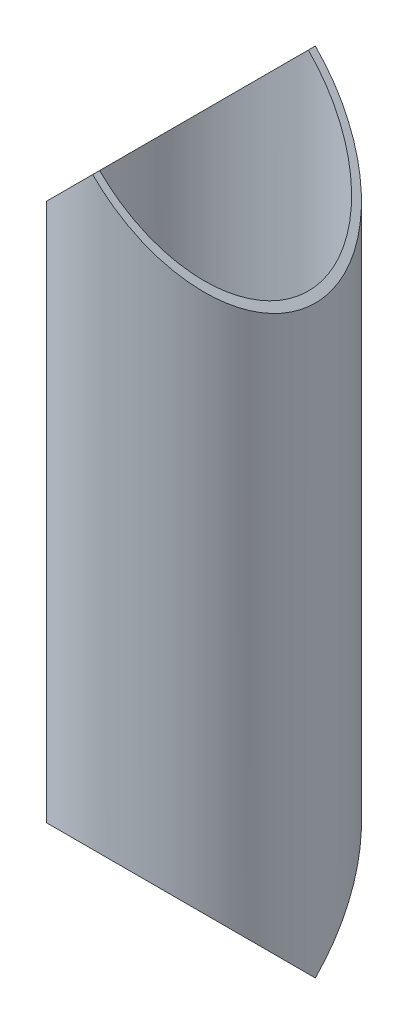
ISO-10303-21;
HEADER;
FILE_DESCRIPTION(('STEP AP214'),'2;1');
FILE_NAME('part.step','',(''),(''),'','','');
FILE_SCHEMA(('AUTOMOTIVE_DESIGN { 1 0 10303 214 1 1 1 1 }'));
ENDSEC;
DATA;
#1=APPLICATION_CONTEXT('core data for automotive mechanical design processes');
#2=APPLICATION_PROTOCOL_DEFINITION('international standard','automotive_design',2000,#1);
#3=PRODUCT_CONTEXT('',#1,'mechanical');
#4=PRODUCT('Part','Part','',(#3));
#5=PRODUCT_RELATED_PRODUCT_CATEGORY('part','',(#4));
#6=PRODUCT_DEFINITION_FORMATION('','',#4);
#7=PRODUCT_DEFINITION_CONTEXT('part definition',#1,'design');
#8=PRODUCT_DEFINITION('design','',#6,#7);
#9=PRODUCT_DEFINITION_SHAPE('','',#8);
#10=(LENGTH_UNIT() NAMED_UNIT(*) SI_UNIT(.MILLI.,.METRE.));
#11=(NAMED_UNIT(*) PLANE_ANGLE_UNIT() SI_UNIT($,.RADIAN.));
#12=(NAMED_UNIT(*) SI_UNIT($,.STERADIAN.) SOLID_ANGLE_UNIT());
#13=UNCERTAINTY_MEASURE_WITH_UNIT(LENGTH_MEASURE(1.E-05),#10,'distance_accuracy_value','');
#14=(GEOMETRIC_REPRESENTATION_CONTEXT(3) GLOBAL_UNCERTAINTY_ASSIGNED_CONTEXT((#13)) GLOBAL_UNIT_ASSIGNED_CONTEXT((#10,
#11,#12)) REPRESENTATION_CONTEXT('',''));
#15=CARTESIAN_POINT('',(0.,0.,0.));
#16=DIRECTION('',(0.,0.,1.));
#17=DIRECTION('',(1.,0.,0.));
#18=AXIS2_PLACEMENT_3D('',#15,#16,#17);
#19=CARTESIAN_POINT('',(0.,158.75,0.));
#20=DIRECTION('',(0.,-1.,0.));
#21=DIRECTION('',(0.,0.,-1.));
#22=AXIS2_PLACEMENT_3D('',#19,#20,#21);
#23=CYLINDRICAL_SURFACE('',#22,25.4);
#24=CARTESIAN_POINT('',(0.,158.75,0.));
#25=DIRECTION('',(0.707106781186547,-0.707106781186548,0.));
#26=DIRECTION('',(-0.707106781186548,-0.707106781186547,0.));
#27=AXIS2_PLACEMENT_3D('',#24,#25,#26);
#28=ELLIPSE('',#27,35.9210244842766,25.4);
#29=CARTESIAN_POINT('',(0.,158.75,25.4));
#30=VERTEX_POINT('',#29);
#31=CARTESIAN_POINT('',(0.,158.75,-25.4));
#32=VERTEX_POINT('',#31);
#33=EDGE_CURVE('E86',#30,#32,#28,.T.);
#34=ORIENTED_EDGE('',*,*,#33,.T.);
#35=CARTESIAN_POINT('',(0.,158.75,0.));
#36=DIRECTION('',(-0.707106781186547,-0.707106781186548,0.));
#37=DIRECTION('',(0.707106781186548,-0.707106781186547,0.));
#38=AXIS2_PLACEMENT_3D('',#35,#36,#37);
#39=ELLIPSE('',#38,35.9210244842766,25.4);
#40=EDGE_CURVE('E84',#32,#30,#39,.T.);
#41=ORIENTED_EDGE('',*,*,#40,.T.);
#42=EDGE_LOOP('',(#34,#41));
#43=FACE_BOUND('',#42,.T.);
#44=CARTESIAN_POINT('',(0.,0.,0.));
#45=DIRECTION('',(0.,0.707106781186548,0.707106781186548));
#46=DIRECTION('',(0.,-0.707106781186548,0.707106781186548));
#47=AXIS2_PLACEMENT_3D('',#44,#45,#46);
#48=ELLIPSE('',#47,35.9210244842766,25.4);
#49=CARTESIAN_POINT('',(25.4,0.,0.));
#50=VERTEX_POINT('',#49);
#51=CARTESIAN_POINT('',(-25.4,0.,0.));
#52=VERTEX_POINT('',#51);
#53=EDGE_CURVE('E45',#50,#52,#48,.T.);
#54=ORIENTED_EDGE('',*,*,#53,.T.);
#55=CARTESIAN_POINT('',(0.,0.,0.));
#56=DIRECTION('',(0.,0.707106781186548,-0.707106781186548));
#57=DIRECTION('',(0.,-0.707106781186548,-0.707106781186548));
#58=AXIS2_PLACEMENT_3D('',#55,#56,#57);
#59=ELLIPSE('',#58,35.9210244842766,25.4);
#60=EDGE_CURVE('E69',#52,#50,#59,.T.);
#61=ORIENTED_EDGE('',*,*,#60,.T.);
#62=EDGE_LOOP('',(#54,#61));
#63=FACE_BOUND('',#62,.T.);
#64=ADVANCED_FACE('F32',(#43,#63),#23,.T.);
#65=CARTESIAN_POINT('',(0.,158.75,0.));
#66=DIRECTION('',(0.,-1.,0.));
#67=DIRECTION('',(0.,0.,-1.));
#68=AXIS2_PLACEMENT_3D('',#65,#66,#67);
#69=CYLINDRICAL_SURFACE('',#68,23.8125);
#70=CARTESIAN_POINT('',(0.,0.,0.));
#71=DIRECTION('',(0.,0.707106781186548,-0.707106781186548));
#72=DIRECTION('',(0.,-0.707106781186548,-0.707106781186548));
#73=AXIS2_PLACEMENT_3D('',#70,#71,#72);
#74=ELLIPSE('',#73,33.6759604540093,23.8125);
#75=CARTESIAN_POINT('',(-23.8125,0.,0.));
#76=VERTEX_POINT('',#75);
#77=CARTESIAN_POINT('',(23.8125,0.,0.));
#78=VERTEX_POINT('',#77);
#79=EDGE_CURVE('E11',#76,#78,#74,.T.);
#80=ORIENTED_EDGE('',*,*,#79,.F.);
#81=CARTESIAN_POINT('',(0.,0.,0.));
#82=DIRECTION('',(0.,0.707106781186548,0.707106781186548));
#83=DIRECTION('',(0.,-0.707106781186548,0.707106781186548));
#84=AXIS2_PLACEMENT_3D('',#81,#82,#83);
#85=ELLIPSE('',#84,33.6759604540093,23.8125);
#86=EDGE_CURVE('E39',#78,#76,#85,.T.);
#87=ORIENTED_EDGE('',*,*,#86,.F.);
#88=EDGE_LOOP('',(#80,#87));
#89=FACE_BOUND('',#88,.T.);
#90=CARTESIAN_POINT('',(0.,158.75,0.));
#91=DIRECTION('',(0.707106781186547,-0.707106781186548,0.));
#92=DIRECTION('',(-0.707106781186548,-0.707106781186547,0.));
#93=AXIS2_PLACEMENT_3D('',#90,#91,#92);
#94=ELLIPSE('',#93,33.6759604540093,23.8125);
#95=CARTESIAN_POINT('',(0.,158.75,23.8125));
#96=VERTEX_POINT('',#95);
#97=CARTESIAN_POINT('',(0.,158.75,-23.8125));
#98=VERTEX_POINT('',#97);
#99=EDGE_CURVE('E90',#96,#98,#94,.T.);
#100=ORIENTED_EDGE('',*,*,#99,.F.);
#101=CARTESIAN_POINT('',(0.,158.75,0.));
#102=DIRECTION('',(-0.707106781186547,-0.707106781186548,0.));
#103=DIRECTION('',(0.707106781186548,-0.707106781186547,0.));
#104=AXIS2_PLACEMENT_3D('',#101,#102,#103);
#105=ELLIPSE('',#104,33.6759604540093,23.8125);
#106=EDGE_CURVE('E88',#98,#96,#105,.T.);
#107=ORIENTED_EDGE('',*,*,#106,.F.);
#108=EDGE_LOOP('',(#100,#107));
#109=FACE_BOUND('',#108,.T.);
#110=ADVANCED_FACE('F93',(#89,#109),#69,.F.);
#111=CARTESIAN_POINT('',(-25.4,133.35,-25.4));
#112=DIRECTION('',(0.707106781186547,-0.707106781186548,0.));
#113=DIRECTION('',(0.707106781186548,0.707106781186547,0.));
#114=AXIS2_PLACEMENT_3D('',#111,#112,#113);
#115=PLANE('',#114);
#116=ORIENTED_EDGE('',*,*,#33,.F.);
#117=DIRECTION('',(0.,0.,1.));
#118=VECTOR('',#117,1.);
#119=CARTESIAN_POINT('',(0.,158.75,-25.4));
#120=LINE('',#119,#118);
#121=EDGE_CURVE('E72',#96,#30,#120,.T.);
#122=ORIENTED_EDGE('',*,*,#121,.F.);
#123=ORIENTED_EDGE('',*,*,#99,.T.);
#124=EDGE_CURVE('E82',#32,#98,#120,.T.);
#125=ORIENTED_EDGE('',*,*,#124,.F.);
#126=EDGE_LOOP('',(#116,#122,#123,#125));
#127=FACE_BOUND('',#126,.T.);
#128=ADVANCED_FACE('F96',(#127),#115,.F.);
#129=CARTESIAN_POINT('',(0.,158.75,-25.4));
#130=DIRECTION('',(-0.707106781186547,-0.707106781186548,0.));
#131=DIRECTION('',(0.707106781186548,-0.707106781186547,0.));
#132=AXIS2_PLACEMENT_3D('',#129,#130,#131);
#133=PLANE('',#132);
#134=ORIENTED_EDGE('',*,*,#40,.F.);
#135=ORIENTED_EDGE('',*,*,#124,.T.);
#136=ORIENTED_EDGE('',*,*,#106,.T.);
#137=ORIENTED_EDGE('',*,*,#121,.T.);
#138=EDGE_LOOP('',(#134,#135,#136,#137));
#139=FACE_BOUND('',#138,.T.);
#140=ADVANCED_FACE('F106',(#139),#133,.F.);
#141=CARTESIAN_POINT('',(-25.4,0.,0.));
#142=DIRECTION('',(0.,0.707106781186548,-0.707106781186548));
#143=DIRECTION('',(0.,0.707106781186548,0.707106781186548));
#144=AXIS2_PLACEMENT_3D('',#141,#142,#143);
#145=PLANE('',#144);
#146=DIRECTION('',(1.,0.,0.));
#147=VECTOR('',#146,1.);
#148=CARTESIAN_POINT('',(-25.4,0.,0.));
#149=LINE('',#148,#147);
#150=EDGE_CURVE('E75',#52,#76,#149,.T.);
#151=ORIENTED_EDGE('',*,*,#150,.T.);
#152=ORIENTED_EDGE('',*,*,#79,.T.);
#153=EDGE_CURVE('E52',#78,#50,#149,.T.);
#154=ORIENTED_EDGE('',*,*,#153,.T.);
#155=ORIENTED_EDGE('',*,*,#60,.F.);
#156=EDGE_LOOP('',(#151,#152,#154,#155));
#157=FACE_BOUND('',#156,.T.);
#158=ADVANCED_FACE('F77',(#157),#145,.F.);
#159=CARTESIAN_POINT('',(-25.4,25.4,-25.4));
#160=DIRECTION('',(0.,0.707106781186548,0.707106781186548));
#161=DIRECTION('',(0.,-0.707106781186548,0.707106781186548));
#162=AXIS2_PLACEMENT_3D('',#159,#160,#161);
#163=PLANE('',#162);
#164=ORIENTED_EDGE('',*,*,#153,.F.);
#165=ORIENTED_EDGE('',*,*,#86,.T.);
#166=ORIENTED_EDGE('',*,*,#150,.F.);
#167=ORIENTED_EDGE('',*,*,#53,.F.);
#168=EDGE_LOOP('',(#164,#165,#166,#167));
#169=FACE_BOUND('',#168,.T.);
#170=ADVANCED_FACE('F74',(#169),#163,.F.);
#171=CLOSED_SHELL('',(#64,#110,#128,#140,#158,#170));
#172=MANIFOLD_SOLID_BREP('B2',#171);
#173=ADVANCED_BREP_SHAPE_REPRESENTATION('',(#18,#172),#14);
#174=SHAPE_DEFINITION_REPRESENTATION(#9,#173);
ENDSEC;
END-ISO-10303-21;
